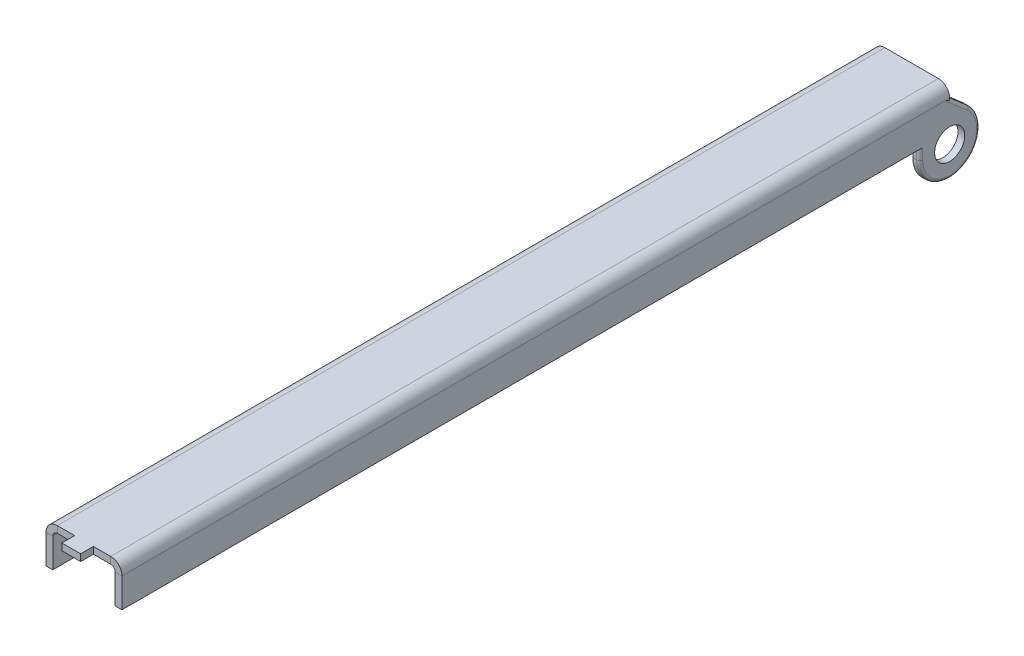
ISO-10303-21;
HEADER;
FILE_DESCRIPTION(('STEP AP214'),'2;1');
FILE_NAME('part.step','',(''),(''),'','','');
FILE_SCHEMA(('AUTOMOTIVE_DESIGN { 1 0 10303 214 1 1 1 1 }'));
ENDSEC;
DATA;
#1=APPLICATION_CONTEXT('core data for automotive mechanical design processes');
#2=APPLICATION_PROTOCOL_DEFINITION('international standard','automotive_design',2000,#1);
#3=PRODUCT_CONTEXT('',#1,'mechanical');
#4=PRODUCT('Part','Part','',(#3));
#5=PRODUCT_RELATED_PRODUCT_CATEGORY('part','',(#4));
#6=PRODUCT_DEFINITION_FORMATION('','',#4);
#7=PRODUCT_DEFINITION_CONTEXT('part definition',#1,'design');
#8=PRODUCT_DEFINITION('design','',#6,#7);
#9=PRODUCT_DEFINITION_SHAPE('','',#8);
#10=(LENGTH_UNIT() NAMED_UNIT(*) SI_UNIT(.MILLI.,.METRE.));
#11=(NAMED_UNIT(*) PLANE_ANGLE_UNIT() SI_UNIT($,.RADIAN.));
#12=(NAMED_UNIT(*) SI_UNIT($,.STERADIAN.) SOLID_ANGLE_UNIT());
#13=UNCERTAINTY_MEASURE_WITH_UNIT(LENGTH_MEASURE(1.E-05),#10,'distance_accuracy_value','');
#14=(GEOMETRIC_REPRESENTATION_CONTEXT(3) GLOBAL_UNCERTAINTY_ASSIGNED_CONTEXT((#13)) GLOBAL_UNIT_ASSIGNED_CONTEXT((#10,
#11,#12)) REPRESENTATION_CONTEXT('',''));
#15=CARTESIAN_POINT('',(0.,0.,0.));
#16=DIRECTION('',(0.,0.,1.));
#17=DIRECTION('',(1.,0.,0.));
#18=AXIS2_PLACEMENT_3D('',#15,#16,#17);
#19=CARTESIAN_POINT('',(-5.2705,-1.905,139.7));
#20=DIRECTION('',(0.,0.,1.));
#21=DIRECTION('',(1.,0.,0.));
#22=AXIS2_PLACEMENT_3D('',#19,#20,#21);
#23=PLANE('',#22);
#24=DIRECTION('',(0.,1.,0.));
#25=VECTOR('',#24,1.);
#26=CARTESIAN_POINT('',(1.5875,-1.143,139.7));
#27=LINE('',#26,#25);
#28=CARTESIAN_POINT('',(1.5875,-1.143,139.7));
#29=VERTEX_POINT('',#28);
#30=CARTESIAN_POINT('',(1.5875,0.,139.7));
#31=VERTEX_POINT('',#30);
#32=EDGE_CURVE('E237',#29,#31,#27,.T.);
#33=ORIENTED_EDGE('',*,*,#32,.F.);
#34=DIRECTION('',(1.,0.,0.));
#35=VECTOR('',#34,1.);
#36=CARTESIAN_POINT('',(-6.4135,-1.143,139.7));
#37=LINE('',#36,#35);
#38=CARTESIAN_POINT('',(4.5085,-1.143,139.7));
#39=VERTEX_POINT('',#38);
#40=EDGE_CURVE('E329',#29,#39,#37,.T.);
#41=ORIENTED_EDGE('',*,*,#40,.T.);
#42=DIRECTION('',(0.,1.,0.));
#43=VECTOR('',#42,1.);
#44=CARTESIAN_POINT('',(4.5085,-1.143,139.7));
#45=LINE('',#44,#43);
#46=CARTESIAN_POINT('',(4.5085,0.,139.7));
#47=VERTEX_POINT('',#46);
#48=EDGE_CURVE('E372',#39,#47,#45,.T.);
#49=ORIENTED_EDGE('',*,*,#48,.T.);
#50=DIRECTION('',(1.,0.,0.));
#51=VECTOR('',#50,1.);
#52=CARTESIAN_POINT('',(-6.4135,0.,139.7));
#53=LINE('',#52,#51);
#54=EDGE_CURVE('E312',#31,#47,#53,.T.);
#55=ORIENTED_EDGE('',*,*,#54,.F.);
#56=EDGE_LOOP('',(#33,#41,#49,#55));
#57=FACE_BOUND('',#56,.T.);
#58=ADVANCED_FACE('F33',(#57),#23,.T.);
#59=CARTESIAN_POINT('',(-4.5085,0.,139.7));
#60=DIRECTION('',(0.,0.,1.));
#61=DIRECTION('',(1.,0.,0.));
#62=AXIS2_PLACEMENT_3D('',#59,#60,#61);
#63=PLANE('',#62);
#64=DIRECTION('',(0.,-1.,0.));
#65=VECTOR('',#64,1.);
#66=CARTESIAN_POINT('',(-4.5085,0.,139.7));
#67=LINE('',#66,#65);
#68=CARTESIAN_POINT('',(-4.5085,0.,139.7));
#69=VERTEX_POINT('',#68);
#70=CARTESIAN_POINT('',(-4.5085,-1.143,139.7));
#71=VERTEX_POINT('',#70);
#72=EDGE_CURVE('E383',#69,#71,#67,.T.);
#73=ORIENTED_EDGE('',*,*,#72,.F.);
#74=CARTESIAN_POINT('',(-4.5085,-1.905,139.7));
#75=DIRECTION('',(0.,0.,1.));
#76=DIRECTION('',(1.,0.,0.));
#77=AXIS2_PLACEMENT_3D('',#74,#75,#76);
#78=CIRCLE('',#77,1.905);
#79=CARTESIAN_POINT('',(-6.4135,-1.905,139.7));
#80=VERTEX_POINT('',#79);
#81=EDGE_CURVE('E314',#80,#69,#78,.F.);
#82=ORIENTED_EDGE('',*,*,#81,.F.);
#83=DIRECTION('',(-1.,0.,0.));
#84=VECTOR('',#83,1.);
#85=CARTESIAN_POINT('',(-5.2705,-1.905,139.7));
#86=LINE('',#85,#84);
#87=CARTESIAN_POINT('',(-5.2705,-1.905,139.7));
#88=VERTEX_POINT('',#87);
#89=EDGE_CURVE('E381',#88,#80,#86,.T.);
#90=ORIENTED_EDGE('',*,*,#89,.F.);
#91=CARTESIAN_POINT('',(-4.5085,-1.905,139.7));
#92=DIRECTION('',(0.,0.,1.));
#93=DIRECTION('',(1.,0.,0.));
#94=AXIS2_PLACEMENT_3D('',#91,#92,#93);
#95=CIRCLE('',#94,0.762);
#96=EDGE_CURVE('E326',#88,#71,#95,.F.);
#97=ORIENTED_EDGE('',*,*,#96,.T.);
#98=EDGE_LOOP('',(#73,#82,#90,#97));
#99=FACE_BOUND('',#98,.T.);
#100=ADVANCED_FACE('F35',(#99),#63,.T.);
#101=DIRECTION('',(0.,1.,0.));
#102=VECTOR('',#101,1.);
#103=CARTESIAN_POINT('',(-1.5875,-1.143,139.7));
#104=LINE('',#103,#102);
#105=CARTESIAN_POINT('',(-1.5875,-1.143,139.7));
#106=VERTEX_POINT('',#105);
#107=CARTESIAN_POINT('',(-1.5875,0.,139.7));
#108=VERTEX_POINT('',#107);
#109=EDGE_CURVE('E212',#106,#108,#104,.T.);
#110=ORIENTED_EDGE('',*,*,#109,.T.);
#111=EDGE_CURVE('E223',#69,#108,#53,.T.);
#112=ORIENTED_EDGE('',*,*,#111,.F.);
#113=ORIENTED_EDGE('',*,*,#72,.T.);
#114=EDGE_CURVE('E330',#71,#106,#37,.T.);
#115=ORIENTED_EDGE('',*,*,#114,.T.);
#116=EDGE_LOOP('',(#110,#112,#113,#115));
#117=FACE_BOUND('',#116,.T.);
#118=ADVANCED_FACE('F466',(#117),#23,.T.);
#119=CARTESIAN_POINT('',(-6.4135,-1.905,0.));
#120=DIRECTION('',(0.,0.,-1.));
#121=DIRECTION('',(-1.,0.,0.));
#122=AXIS2_PLACEMENT_3D('',#119,#120,#121);
#123=PLANE('',#122);
#124=DIRECTION('',(1.,0.,0.));
#125=VECTOR('',#124,1.);
#126=CARTESIAN_POINT('',(-6.4135,-1.905,0.));
#127=LINE('',#126,#125);
#128=CARTESIAN_POINT('',(-5.9055,-1.905,0.));
#129=VERTEX_POINT('',#128);
#130=CARTESIAN_POINT('',(-5.2705,-1.905,0.));
#131=VERTEX_POINT('',#130);
#132=EDGE_CURVE('E379',#129,#131,#127,.T.);
#133=ORIENTED_EDGE('',*,*,#132,.F.);
#134=CARTESIAN_POINT('',(-5.9055,-2.57810000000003,0.));
#135=DIRECTION('',(0.,0.,-1.));
#136=DIRECTION('',(0.,-1.,0.));
#137=AXIS2_PLACEMENT_3D('',#134,#135,#136);
#138=ELLIPSE('',#137,0.6731,0.508);
#139=CARTESIAN_POINT('',(-6.37055128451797,-2.30723129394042,0.));
#140=VERTEX_POINT('',#139);
#141=EDGE_CURVE('E414',#129,#140,#138,.F.);
#142=ORIENTED_EDGE('',*,*,#141,.T.);
#143=CARTESIAN_POINT('',(-4.5085,-1.905,0.));
#144=DIRECTION('',(0.,0.,1.));
#145=DIRECTION('',(1.,0.,0.));
#146=AXIS2_PLACEMENT_3D('',#143,#144,#145);
#147=CIRCLE('',#146,1.905);
#148=CARTESIAN_POINT('',(-4.5085,0.,0.));
#149=VERTEX_POINT('',#148);
#150=EDGE_CURVE('E55',#140,#149,#147,.F.);
#151=ORIENTED_EDGE('',*,*,#150,.T.);
#152=DIRECTION('',(0.,1.,0.));
#153=VECTOR('',#152,1.);
#154=CARTESIAN_POINT('',(-4.5085,-1.143,0.));
#155=LINE('',#154,#153);
#156=CARTESIAN_POINT('',(-4.5085,-1.143,0.));
#157=VERTEX_POINT('',#156);
#158=EDGE_CURVE('E377',#157,#149,#155,.T.);
#159=ORIENTED_EDGE('',*,*,#158,.F.);
#160=CARTESIAN_POINT('',(-4.5085,-1.905,0.));
#161=DIRECTION('',(0.,0.,1.));
#162=DIRECTION('',(1.,0.,0.));
#163=AXIS2_PLACEMENT_3D('',#160,#161,#162);
#164=CIRCLE('',#163,0.762);
#165=EDGE_CURVE('E292',#131,#157,#164,.F.);
#166=ORIENTED_EDGE('',*,*,#165,.F.);
#167=EDGE_LOOP('',(#133,#142,#151,#159,#166));
#168=FACE_BOUND('',#167,.T.);
#169=ADVANCED_FACE('F475',(#168),#123,.T.);
#170=CARTESIAN_POINT('',(6.4135,-1.905,139.7));
#171=DIRECTION('',(0.,0.,1.));
#172=DIRECTION('',(1.,0.,0.));
#173=AXIS2_PLACEMENT_3D('',#170,#171,#172);
#174=PLANE('',#173);
#175=DIRECTION('',(-1.,0.,0.));
#176=VECTOR('',#175,1.);
#177=CARTESIAN_POINT('',(6.4135,-1.905,139.7));
#178=LINE('',#177,#176);
#179=CARTESIAN_POINT('',(6.4135,-1.905,139.7));
#180=VERTEX_POINT('',#179);
#181=CARTESIAN_POINT('',(5.2705,-1.905,139.7));
#182=VERTEX_POINT('',#181);
#183=EDGE_CURVE('E375',#180,#182,#178,.T.);
#184=ORIENTED_EDGE('',*,*,#183,.F.);
#185=CARTESIAN_POINT('',(4.5085,-1.905,139.7));
#186=DIRECTION('',(0.,0.,1.));
#187=DIRECTION('',(1.,0.,0.));
#188=AXIS2_PLACEMENT_3D('',#185,#186,#187);
#189=CIRCLE('',#188,1.905);
#190=EDGE_CURVE('E309',#47,#180,#189,.F.);
#191=ORIENTED_EDGE('',*,*,#190,.F.);
#192=ORIENTED_EDGE('',*,*,#48,.F.);
#193=CARTESIAN_POINT('',(4.5085,-1.905,139.7));
#194=DIRECTION('',(0.,0.,1.));
#195=DIRECTION('',(1.,0.,0.));
#196=AXIS2_PLACEMENT_3D('',#193,#194,#195);
#197=CIRCLE('',#196,0.762);
#198=EDGE_CURVE('E332',#39,#182,#197,.F.);
#199=ORIENTED_EDGE('',*,*,#198,.T.);
#200=EDGE_LOOP('',(#184,#191,#192,#199));
#201=FACE_BOUND('',#200,.T.);
#202=ADVANCED_FACE('F480',(#201),#174,.T.);
#203=CARTESIAN_POINT('',(4.5085,-1.143,139.7));
#204=DIRECTION('',(0.,0.,1.));
#205=DIRECTION('',(1.,0.,0.));
#206=AXIS2_PLACEMENT_3D('',#203,#204,#205);
#207=PLANE('',#206);
#208=DIRECTION('',(0.,-1.,0.));
#209=VECTOR('',#208,1.);
#210=CARTESIAN_POINT('',(6.4135,0.,139.7));
#211=LINE('',#210,#209);
#212=CARTESIAN_POINT('',(6.4135,-6.858,139.7));
#213=VERTEX_POINT('',#212);
#214=EDGE_CURVE('E306',#180,#213,#211,.T.);
#215=ORIENTED_EDGE('',*,*,#214,.F.);
#216=ORIENTED_EDGE('',*,*,#183,.T.);
#217=DIRECTION('',(0.,1.,0.));
#218=VECTOR('',#217,1.);
#219=CARTESIAN_POINT('',(5.2705,0.,139.7));
#220=LINE('',#219,#218);
#221=CARTESIAN_POINT('',(5.2705,-6.858,139.7));
#222=VERTEX_POINT('',#221);
#223=EDGE_CURVE('E301',#182,#222,#220,.F.);
#224=ORIENTED_EDGE('',*,*,#223,.T.);
#225=DIRECTION('',(-1.,0.,0.));
#226=VECTOR('',#225,1.);
#227=CARTESIAN_POINT('',(6.4135,-6.858,139.7));
#228=LINE('',#227,#226);
#229=EDGE_CURVE('E303',#213,#222,#228,.T.);
#230=ORIENTED_EDGE('',*,*,#229,.F.);
#231=EDGE_LOOP('',(#215,#216,#224,#230));
#232=FACE_BOUND('',#231,.T.);
#233=ADVANCED_FACE('F587',(#232),#207,.T.);
#234=CARTESIAN_POINT('',(4.5085,0.,0.));
#235=DIRECTION('',(0.,0.,-1.));
#236=DIRECTION('',(-1.,0.,0.));
#237=AXIS2_PLACEMENT_3D('',#234,#235,#236);
#238=PLANE('',#237);
#239=DIRECTION('',(0.,-1.,0.));
#240=VECTOR('',#239,1.);
#241=CARTESIAN_POINT('',(4.5085,0.,0.));
#242=LINE('',#241,#240);
#243=CARTESIAN_POINT('',(4.5085,0.,0.));
#244=VERTEX_POINT('',#243);
#245=CARTESIAN_POINT('',(4.5085,-1.143,0.));
#246=VERTEX_POINT('',#245);
#247=EDGE_CURVE('E370',#244,#246,#242,.T.);
#248=ORIENTED_EDGE('',*,*,#247,.F.);
#249=CARTESIAN_POINT('',(4.5085,-1.905,0.));
#250=DIRECTION('',(0.,0.,1.));
#251=DIRECTION('',(1.,0.,0.));
#252=AXIS2_PLACEMENT_3D('',#249,#250,#251);
#253=CIRCLE('',#252,1.905);
#254=CARTESIAN_POINT('',(6.37055128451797,-2.3072312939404,0.));
#255=VERTEX_POINT('',#254);
#256=EDGE_CURVE('E47',#244,#255,#253,.F.);
#257=ORIENTED_EDGE('',*,*,#256,.T.);
#258=CARTESIAN_POINT('',(5.9055,-2.57809999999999,0.));
#259=DIRECTION('',(0.,0.,-1.));
#260=DIRECTION('',(0.,1.,0.));
#261=AXIS2_PLACEMENT_3D('',#258,#259,#260);
#262=ELLIPSE('',#261,0.6731,0.508);
#263=CARTESIAN_POINT('',(5.9055,-1.905,0.));
#264=VERTEX_POINT('',#263);
#265=EDGE_CURVE('E11',#255,#264,#262,.F.);
#266=ORIENTED_EDGE('',*,*,#265,.T.);
#267=DIRECTION('',(1.,0.,0.));
#268=VECTOR('',#267,1.);
#269=CARTESIAN_POINT('',(5.2705,-1.905,0.));
#270=LINE('',#269,#268);
#271=CARTESIAN_POINT('',(5.2705,-1.905,0.));
#272=VERTEX_POINT('',#271);
#273=EDGE_CURVE('E367',#272,#264,#270,.T.);
#274=ORIENTED_EDGE('',*,*,#273,.F.);
#275=CARTESIAN_POINT('',(4.5085,-1.905,0.));
#276=DIRECTION('',(0.,0.,1.));
#277=DIRECTION('',(1.,0.,0.));
#278=AXIS2_PLACEMENT_3D('',#275,#276,#277);
#279=CIRCLE('',#278,0.762);
#280=EDGE_CURVE('E298',#246,#272,#279,.F.);
#281=ORIENTED_EDGE('',*,*,#280,.F.);
#282=EDGE_LOOP('',(#248,#257,#266,#274,#281));
#283=FACE_BOUND('',#282,.T.);
#284=ADVANCED_FACE('F569',(#283),#238,.T.);
#285=CARTESIAN_POINT('',(5.2705,-1.905,0.));
#286=DIRECTION('',(0.,0.,-1.));
#287=DIRECTION('',(-1.,0.,0.));
#288=AXIS2_PLACEMENT_3D('',#285,#286,#287);
#289=PLANE('',#288);
#290=DIRECTION('',(1.,0.,0.));
#291=VECTOR('',#290,1.);
#292=CARTESIAN_POINT('',(-6.4135,0.,0.));
#293=LINE('',#292,#291);
#294=EDGE_CURVE('E288',#149,#244,#293,.T.);
#295=ORIENTED_EDGE('',*,*,#294,.T.);
#296=ORIENTED_EDGE('',*,*,#247,.T.);
#297=DIRECTION('',(1.,0.,0.));
#298=VECTOR('',#297,1.);
#299=CARTESIAN_POINT('',(-6.4135,-1.143,0.));
#300=LINE('',#299,#298);
#301=EDGE_CURVE('E295',#157,#246,#300,.T.);
#302=ORIENTED_EDGE('',*,*,#301,.F.);
#303=ORIENTED_EDGE('',*,*,#158,.T.);
#304=EDGE_LOOP('',(#295,#296,#302,#303));
#305=FACE_BOUND('',#304,.T.);
#306=ADVANCED_FACE('F562',(#305),#289,.T.);
#307=CARTESIAN_POINT('',(5.2705,0.,139.7));
#308=DIRECTION('',(1.,0.,0.));
#309=DIRECTION('',(0.,0.,-1.));
#310=AXIS2_PLACEMENT_3D('',#307,#308,#309);
#311=PLANE('',#310);
#312=CARTESIAN_POINT('',(5.2705,-8.636,0.));
#313=DIRECTION('',(1.,0.,0.));
#314=DIRECTION('',(0.,0.,-1.));
#315=AXIS2_PLACEMENT_3D('',#312,#313,#314);
#316=CIRCLE('',#315,2.54);
#317=CARTESIAN_POINT('',(5.2705,-8.636,-2.54));
#318=VERTEX_POINT('',#317);
#319=EDGE_CURVE('E249',#318,#318,#316,.T.);
#320=ORIENTED_EDGE('',*,*,#319,.T.);
#321=EDGE_LOOP('',(#320));
#322=FACE_BOUND('',#321,.T.);
#323=DIRECTION('',(0.,-1.,0.));
#324=VECTOR('',#323,1.);
#325=CARTESIAN_POINT('',(5.2705,-6.858,5.08));
#326=LINE('',#325,#324);
#327=CARTESIAN_POINT('',(5.2705,-6.858,5.08));
#328=VERTEX_POINT('',#327);
#329=CARTESIAN_POINT('',(5.2705,-8.636,5.08));
#330=VERTEX_POINT('',#329);
#331=EDGE_CURVE('E264',#328,#330,#326,.T.);
#332=ORIENTED_EDGE('',*,*,#331,.F.);
#333=DIRECTION('',(0.,0.,-1.));
#334=VECTOR('',#333,1.);
#335=CARTESIAN_POINT('',(5.2705,-6.858,139.7));
#336=LINE('',#335,#334);
#337=EDGE_CURVE('E365',#222,#328,#336,.T.);
#338=ORIENTED_EDGE('',*,*,#337,.F.);
#339=ORIENTED_EDGE('',*,*,#223,.F.);
#340=DIRECTION('',(0.,0.,-1.));
#341=VECTOR('',#340,1.);
#342=CARTESIAN_POINT('',(5.2705,-1.905,139.7));
#343=LINE('',#342,#341);
#344=EDGE_CURVE('E335',#182,#272,#343,.T.);
#345=ORIENTED_EDGE('',*,*,#344,.T.);
#346=DIRECTION('',(0.,0.656050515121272,0.754716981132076));
#347=VECTOR('',#346,1.);
#348=CARTESIAN_POINT('',(5.2705,-1.905,0.));
#349=LINE('',#348,#347);
#350=CARTESIAN_POINT('',(5.2705,-4.80203773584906,-3.33273661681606));
#351=VERTEX_POINT('',#350);
#352=EDGE_CURVE('E275',#351,#272,#349,.T.);
#353=ORIENTED_EDGE('',*,*,#352,.F.);
#354=CARTESIAN_POINT('',(5.2705,-8.636,0.));
#355=DIRECTION('',(1.,0.,0.));
#356=DIRECTION('',(0.,0.,-1.));
#357=AXIS2_PLACEMENT_3D('',#354,#355,#356);
#358=CIRCLE('',#357,5.08);
#359=EDGE_CURVE('E272',#330,#351,#358,.T.);
#360=ORIENTED_EDGE('',*,*,#359,.F.);
#361=EDGE_LOOP('',(#332,#338,#339,#345,#353,#360));
#362=FACE_BOUND('',#361,.T.);
#363=ADVANCED_FACE('F584',(#322,#362),#311,.F.);
#364=CARTESIAN_POINT('',(6.4135,-6.858,139.7));
#365=DIRECTION('',(0.,-1.,0.));
#366=DIRECTION('',(0.,0.,-1.));
#367=AXIS2_PLACEMENT_3D('',#364,#365,#366);
#368=PLANE('',#367);
#369=DIRECTION('',(1.,0.,0.));
#370=VECTOR('',#369,1.);
#371=CARTESIAN_POINT('',(5.2705,-6.858,5.08));
#372=LINE('',#371,#370);
#373=CARTESIAN_POINT('',(5.9055,-6.858,5.08));
#374=VERTEX_POINT('',#373);
#375=EDGE_CURVE('E278',#328,#374,#372,.T.);
#376=ORIENTED_EDGE('',*,*,#375,.T.);
#377=CARTESIAN_POINT('',(5.9055,-6.858,4.57199999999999));
#378=DIRECTION('',(0.,-1.,0.));
#379=DIRECTION('',(0.,0.,-1.));
#380=AXIS2_PLACEMENT_3D('',#377,#378,#379);
#381=CIRCLE('',#380,0.508);
#382=CARTESIAN_POINT('',(6.4135,-6.858,4.57199999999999));
#383=VERTEX_POINT('',#382);
#384=EDGE_CURVE('E448',#374,#383,#381,.F.);
#385=ORIENTED_EDGE('',*,*,#384,.T.);
#386=DIRECTION('',(0.,0.,-1.));
#387=VECTOR('',#386,1.);
#388=CARTESIAN_POINT('',(6.4135,-6.858,139.7));
#389=LINE('',#388,#387);
#390=EDGE_CURVE('E363',#213,#383,#389,.T.);
#391=ORIENTED_EDGE('',*,*,#390,.F.);
#392=ORIENTED_EDGE('',*,*,#229,.T.);
#393=ORIENTED_EDGE('',*,*,#337,.T.);
#394=EDGE_LOOP('',(#376,#385,#391,#392,#393));
#395=FACE_BOUND('',#394,.T.);
#396=ADVANCED_FACE('F513',(#395),#368,.T.);
#397=CARTESIAN_POINT('',(6.4135,0.,139.7));
#398=DIRECTION('',(1.,0.,0.));
#399=DIRECTION('',(0.,0.,-1.));
#400=AXIS2_PLACEMENT_3D('',#397,#398,#399);
#401=PLANE('',#400);
#402=ORIENTED_EDGE('',*,*,#390,.T.);
#403=DIRECTION('',(0.,-1.,0.));
#404=VECTOR('',#403,1.);
#405=CARTESIAN_POINT('',(6.4135,0.,4.57199999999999));
#406=LINE('',#405,#404);
#407=CARTESIAN_POINT('',(6.4135,-8.636,4.572));
#408=VERTEX_POINT('',#407);
#409=EDGE_CURVE('E403',#383,#408,#406,.T.);
#410=ORIENTED_EDGE('',*,*,#409,.T.);
#411=CARTESIAN_POINT('',(6.4135,-8.636,0.));
#412=DIRECTION('',(1.,0.,0.));
#413=DIRECTION('',(0.,0.,-1.));
#414=AXIS2_PLACEMENT_3D('',#411,#412,#413);
#415=CIRCLE('',#414,4.572);
#416=CARTESIAN_POINT('',(6.4135,-5.18543396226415,-2.99946295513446));
#417=VERTEX_POINT('',#416);
#418=EDGE_CURVE('E399',#408,#417,#415,.T.);
#419=ORIENTED_EDGE('',*,*,#418,.T.);
#420=DIRECTION('',(0.,0.656050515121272,0.754716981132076));
#421=VECTOR('',#420,1.);
#422=CARTESIAN_POINT('',(6.4135,67.7015253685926,80.8493027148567));
#423=LINE('',#422,#421);
#424=CARTESIAN_POINT('',(6.4135,-1.905,0.774330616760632));
#425=VERTEX_POINT('',#424);
#426=EDGE_CURVE('E401',#417,#425,#423,.T.);
#427=ORIENTED_EDGE('',*,*,#426,.T.);
#428=DIRECTION('',(0.,0.,-1.));
#429=VECTOR('',#428,1.);
#430=CARTESIAN_POINT('',(6.4135,-1.905,139.7));
#431=LINE('',#430,#429);
#432=EDGE_CURVE('E360',#180,#425,#431,.T.);
#433=ORIENTED_EDGE('',*,*,#432,.F.);
#434=ORIENTED_EDGE('',*,*,#214,.T.);
#435=EDGE_LOOP('',(#402,#410,#419,#427,#433,#434));
#436=FACE_BOUND('',#435,.T.);
#437=CARTESIAN_POINT('',(6.4135,-8.636,0.));
#438=DIRECTION('',(1.,0.,0.));
#439=DIRECTION('',(0.,0.,-1.));
#440=AXIS2_PLACEMENT_3D('',#437,#438,#439);
#441=CIRCLE('',#440,2.54);
#442=CARTESIAN_POINT('',(6.4135,-8.636,-2.54));
#443=VERTEX_POINT('',#442);
#444=EDGE_CURVE('E238',#443,#443,#441,.T.);
#445=ORIENTED_EDGE('',*,*,#444,.F.);
#446=EDGE_LOOP('',(#445));
#447=FACE_BOUND('',#446,.T.);
#448=ADVANCED_FACE('F442',(#436,#447),#401,.T.);
#449=CARTESIAN_POINT('',(4.5085,-1.905,139.7));
#450=DIRECTION('',(0.,0.,-1.));
#451=DIRECTION('',(-1.,0.,0.));
#452=AXIS2_PLACEMENT_3D('',#449,#450,#451);
#453=CYLINDRICAL_SURFACE('',#452,1.905);
#454=ORIENTED_EDGE('',*,*,#256,.F.);
#455=DIRECTION('',(0.,0.,-1.));
#456=VECTOR('',#455,1.);
#457=CARTESIAN_POINT('',(4.5085,0.,139.7));
#458=LINE('',#457,#456);
#459=EDGE_CURVE('E357',#47,#244,#458,.T.);
#460=ORIENTED_EDGE('',*,*,#459,.F.);
#461=ORIENTED_EDGE('',*,*,#190,.T.);
#462=ORIENTED_EDGE('',*,*,#432,.T.);
#463=CARTESIAN_POINT('',(6.37055128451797,-2.3072312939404,0.));
#464=CARTESIAN_POINT('',(6.37774041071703,-2.27393037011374,0.0632574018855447));
#465=CARTESIAN_POINT('',(6.38398381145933,-2.24072145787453,0.12666234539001));
#466=CARTESIAN_POINT('',(6.39464965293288,-2.17443445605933,0.253696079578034));
#467=CARTESIAN_POINT('',(6.39907204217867,-2.14135637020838,0.317324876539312));
#468=CARTESIAN_POINT('',(6.40970373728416,-2.04232678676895,0.508270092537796));
#469=CARTESIAN_POINT('',(6.41329579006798,-1.97649412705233,0.635809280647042));
#470=CARTESIAN_POINT('',(6.41349716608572,-1.90878571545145,0.766995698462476));
#471=CARTESIAN_POINT('',(6.41349998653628,-1.90689285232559,0.770663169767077));
#472=CARTESIAN_POINT('',(6.4135,-1.90499999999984,0.774330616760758));
#473=B_SPLINE_CURVE_WITH_KNOTS('',3,(#463,#464,#465,#466,#467,#468,#469,#470,#471,#472),
.UNSPECIFIED.,.F.,.F.,(4,2,2,2,4),(0.,0.215524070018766,0.431054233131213,0.861557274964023,
0.873938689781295),.UNSPECIFIED.);
#474=EDGE_CURVE('E41',#425,#255,#473,.F.);
#475=ORIENTED_EDGE('',*,*,#474,.T.);
#476=EDGE_LOOP('',(#454,#460,#461,#462,#475));
#477=FACE_BOUND('',#476,.T.);
#478=ADVANCED_FACE('F438',(#477),#453,.T.);
#479=CARTESIAN_POINT('',(-6.4135,0.,139.7));
#480=DIRECTION('',(0.,1.,0.));
#481=DIRECTION('',(0.,0.,1.));
#482=AXIS2_PLACEMENT_3D('',#479,#480,#481);
#483=PLANE('',#482);
#484=ORIENTED_EDGE('',*,*,#294,.F.);
#485=DIRECTION('',(0.,0.,-1.));
#486=VECTOR('',#485,1.);
#487=CARTESIAN_POINT('',(-4.5085,0.,139.7));
#488=LINE('',#487,#486);
#489=EDGE_CURVE('E355',#69,#149,#488,.T.);
#490=ORIENTED_EDGE('',*,*,#489,.F.);
#491=ORIENTED_EDGE('',*,*,#111,.T.);
#492=DIRECTION('',(0.,0.,1.));
#493=VECTOR('',#492,1.);
#494=CARTESIAN_POINT('',(-1.5875,0.,139.7));
#495=LINE('',#494,#493);
#496=CARTESIAN_POINT('',(-1.5875,0.,141.859));
#497=VERTEX_POINT('',#496);
#498=EDGE_CURVE('E204',#108,#497,#495,.T.);
#499=ORIENTED_EDGE('',*,*,#498,.T.);
#500=DIRECTION('',(1.,0.,0.));
#501=VECTOR('',#500,1.);
#502=CARTESIAN_POINT('',(1.5875,0.,141.859));
#503=LINE('',#502,#501);
#504=CARTESIAN_POINT('',(1.5875,0.,141.859));
#505=VERTEX_POINT('',#504);
#506=EDGE_CURVE('E220',#497,#505,#503,.T.);
#507=ORIENTED_EDGE('',*,*,#506,.T.);
#508=DIRECTION('',(0.,0.,-1.));
#509=VECTOR('',#508,1.);
#510=CARTESIAN_POINT('',(1.5875,0.,139.7));
#511=LINE('',#510,#509);
#512=EDGE_CURVE('E224',#505,#31,#511,.T.);
#513=ORIENTED_EDGE('',*,*,#512,.T.);
#514=ORIENTED_EDGE('',*,*,#54,.T.);
#515=ORIENTED_EDGE('',*,*,#459,.T.);
#516=EDGE_LOOP('',(#484,#490,#491,#499,#507,#513,#514,#515));
#517=FACE_BOUND('',#516,.T.);
#518=ADVANCED_FACE('F218',(#517),#483,.T.);
#519=CARTESIAN_POINT('',(-4.5085,-1.905,139.7));
#520=DIRECTION('',(0.,0.,-1.));
#521=DIRECTION('',(-1.,0.,0.));
#522=AXIS2_PLACEMENT_3D('',#519,#520,#521);
#523=CYLINDRICAL_SURFACE('',#522,1.905);
#524=ORIENTED_EDGE('',*,*,#150,.F.);
#525=CARTESIAN_POINT('',(-6.37055128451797,-2.30723129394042,0.));
#526=CARTESIAN_POINT('',(-6.37774041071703,-2.27393037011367,0.0632574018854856));
#527=CARTESIAN_POINT('',(-6.38398381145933,-2.24072145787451,0.126662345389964));
#528=CARTESIAN_POINT('',(-6.39464965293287,-2.17443445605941,0.253696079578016));
#529=CARTESIAN_POINT('',(-6.39907204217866,-2.14135637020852,0.31732487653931));
#530=CARTESIAN_POINT('',(-6.40970373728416,-2.04232678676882,0.508270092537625));
#531=CARTESIAN_POINT('',(-6.41329579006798,-1.97649412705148,0.635809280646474));
#532=CARTESIAN_POINT('',(-6.41349716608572,-1.90878571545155,0.766995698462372));
#533=CARTESIAN_POINT('',(-6.41349998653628,-1.90689285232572,0.770663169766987));
#534=CARTESIAN_POINT('',(-6.4135,-1.905,0.774330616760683));
#535=B_SPLINE_CURVE_WITH_KNOTS('',3,(#525,#526,#527,#528,#529,#530,#531,#532,#533,#534),
.UNSPECIFIED.,.F.,.F.,(4,2,2,2,4),(0.,0.215524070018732,0.43105423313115,0.861557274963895,
0.873938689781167),.UNSPECIFIED.);
#536=CARTESIAN_POINT('',(-6.4135,-1.905,0.774330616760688));
#537=VERTEX_POINT('',#536);
#538=EDGE_CURVE('E416',#140,#537,#535,.T.);
#539=ORIENTED_EDGE('',*,*,#538,.T.);
#540=DIRECTION('',(0.,0.,-1.));
#541=VECTOR('',#540,1.);
#542=CARTESIAN_POINT('',(-6.4135,-1.905,139.7));
#543=LINE('',#542,#541);
#544=EDGE_CURVE('E352',#80,#537,#543,.T.);
#545=ORIENTED_EDGE('',*,*,#544,.F.);
#546=ORIENTED_EDGE('',*,*,#81,.T.);
#547=ORIENTED_EDGE('',*,*,#489,.T.);
#548=EDGE_LOOP('',(#524,#539,#545,#546,#547));
#549=FACE_BOUND('',#548,.T.);
#550=ADVANCED_FACE('F429',(#549),#523,.T.);
#551=CARTESIAN_POINT('',(-6.4135,0.,139.7));
#552=DIRECTION('',(-1.,0.,0.));
#553=DIRECTION('',(0.,0.,1.));
#554=AXIS2_PLACEMENT_3D('',#551,#552,#553);
#555=PLANE('',#554);
#556=CARTESIAN_POINT('',(-6.4135,-8.636,0.));
#557=DIRECTION('',(-1.,0.,0.));
#558=DIRECTION('',(0.,0.,1.));
#559=AXIS2_PLACEMENT_3D('',#556,#557,#558);
#560=CIRCLE('',#559,2.54);
#561=CARTESIAN_POINT('',(-6.4135,-8.636,2.54));
#562=VERTEX_POINT('',#561);
#563=EDGE_CURVE('E246',#562,#562,#560,.T.);
#564=ORIENTED_EDGE('',*,*,#563,.F.);
#565=EDGE_LOOP('',(#564));
#566=FACE_BOUND('',#565,.T.);
#567=DIRECTION('',(0.,1.,0.));
#568=VECTOR('',#567,1.);
#569=CARTESIAN_POINT('',(-6.4135,0.,4.57199999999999));
#570=LINE('',#569,#568);
#571=CARTESIAN_POINT('',(-6.4135,-8.636,4.572));
#572=VERTEX_POINT('',#571);
#573=CARTESIAN_POINT('',(-6.4135,-6.858,4.57199999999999));
#574=VERTEX_POINT('',#573);
#575=EDGE_CURVE('E389',#572,#574,#570,.T.);
#576=ORIENTED_EDGE('',*,*,#575,.T.);
#577=DIRECTION('',(0.,0.,-1.));
#578=VECTOR('',#577,1.);
#579=CARTESIAN_POINT('',(-6.4135,-6.858,139.7));
#580=LINE('',#579,#578);
#581=CARTESIAN_POINT('',(-6.4135,-6.858,139.7));
#582=VERTEX_POINT('',#581);
#583=EDGE_CURVE('E350',#582,#574,#580,.T.);
#584=ORIENTED_EDGE('',*,*,#583,.F.);
#585=DIRECTION('',(0.,1.,0.));
#586=VECTOR('',#585,1.);
#587=CARTESIAN_POINT('',(-6.4135,0.,139.7));
#588=LINE('',#587,#586);
#589=EDGE_CURVE('E317',#582,#80,#588,.T.);
#590=ORIENTED_EDGE('',*,*,#589,.T.);
#591=ORIENTED_EDGE('',*,*,#544,.T.);
#592=DIRECTION('',(0.,-0.656050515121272,-0.754716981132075));
#593=VECTOR('',#592,1.);
#594=CARTESIAN_POINT('',(-6.4135,67.7015253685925,80.8493027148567));
#595=LINE('',#594,#593);
#596=CARTESIAN_POINT('',(-6.4135,-5.18543396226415,-2.99946295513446));
#597=VERTEX_POINT('',#596);
#598=EDGE_CURVE('E392',#537,#597,#595,.T.);
#599=ORIENTED_EDGE('',*,*,#598,.T.);
#600=CARTESIAN_POINT('',(-6.4135,-8.636,0.));
#601=DIRECTION('',(-1.,0.,0.));
#602=DIRECTION('',(0.,0.,1.));
#603=AXIS2_PLACEMENT_3D('',#600,#601,#602);
#604=CIRCLE('',#603,4.572);
#605=EDGE_CURVE('E385',#597,#572,#604,.T.);
#606=ORIENTED_EDGE('',*,*,#605,.T.);
#607=EDGE_LOOP('',(#576,#584,#590,#591,#599,#606));
#608=FACE_BOUND('',#607,.T.);
#609=ADVANCED_FACE('F434',(#566,#608),#555,.T.);
#610=CARTESIAN_POINT('',(-5.2705,-6.858,139.7));
#611=DIRECTION('',(0.,-1.,0.));
#612=DIRECTION('',(0.,0.,-1.));
#613=AXIS2_PLACEMENT_3D('',#610,#611,#612);
#614=PLANE('',#613);
#615=DIRECTION('',(-1.,0.,0.));
#616=VECTOR('',#615,1.);
#617=CARTESIAN_POINT('',(-5.2705,-6.858,5.08));
#618=LINE('',#617,#616);
#619=CARTESIAN_POINT('',(-5.2705,-6.858,5.08));
#620=VERTEX_POINT('',#619);
#621=CARTESIAN_POINT('',(-5.9055,-6.858,5.08));
#622=VERTEX_POINT('',#621);
#623=EDGE_CURVE('E261',#620,#622,#618,.T.);
#624=ORIENTED_EDGE('',*,*,#623,.F.);
#625=DIRECTION('',(0.,0.,-1.));
#626=VECTOR('',#625,1.);
#627=CARTESIAN_POINT('',(-5.2705,-6.858,139.7));
#628=LINE('',#627,#626);
#629=CARTESIAN_POINT('',(-5.2705,-6.858,139.7));
#630=VERTEX_POINT('',#629);
#631=EDGE_CURVE('E347',#630,#620,#628,.T.);
#632=ORIENTED_EDGE('',*,*,#631,.F.);
#633=DIRECTION('',(-1.,0.,0.));
#634=VECTOR('',#633,1.);
#635=CARTESIAN_POINT('',(-5.2705,-6.858,139.7));
#636=LINE('',#635,#634);
#637=EDGE_CURVE('E320',#630,#582,#636,.T.);
#638=ORIENTED_EDGE('',*,*,#637,.T.);
#639=ORIENTED_EDGE('',*,*,#583,.T.);
#640=CARTESIAN_POINT('',(-5.9055,-6.858,4.57199999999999));
#641=DIRECTION('',(0.,-1.,0.));
#642=DIRECTION('',(0.,0.,-1.));
#643=AXIS2_PLACEMENT_3D('',#640,#641,#642);
#644=CIRCLE('',#643,0.508);
#645=EDGE_CURVE('E423',#574,#622,#644,.F.);
#646=ORIENTED_EDGE('',*,*,#645,.T.);
#647=EDGE_LOOP('',(#624,#632,#638,#639,#646));
#648=FACE_BOUND('',#647,.T.);
#649=ADVANCED_FACE('F518',(#648),#614,.T.);
#650=CARTESIAN_POINT('',(-5.2705,0.,139.7));
#651=DIRECTION('',(-1.,0.,0.));
#652=DIRECTION('',(0.,0.,1.));
#653=AXIS2_PLACEMENT_3D('',#650,#651,#652);
#654=PLANE('',#653);
#655=CARTESIAN_POINT('',(-5.2705,-8.636,0.));
#656=DIRECTION('',(-1.,0.,0.));
#657=DIRECTION('',(0.,0.,1.));
#658=AXIS2_PLACEMENT_3D('',#655,#656,#657);
#659=CIRCLE('',#658,2.54);
#660=CARTESIAN_POINT('',(-5.2705,-8.636,2.54));
#661=VERTEX_POINT('',#660);
#662=EDGE_CURVE('E245',#661,#661,#659,.T.);
#663=ORIENTED_EDGE('',*,*,#662,.T.);
#664=EDGE_LOOP('',(#663));
#665=FACE_BOUND('',#664,.T.);
#666=ORIENTED_EDGE('',*,*,#631,.T.);
#667=DIRECTION('',(0.,1.,0.));
#668=VECTOR('',#667,1.);
#669=CARTESIAN_POINT('',(-5.2705,-6.858,5.08));
#670=LINE('',#669,#668);
#671=CARTESIAN_POINT('',(-5.2705,-8.636,5.08));
#672=VERTEX_POINT('',#671);
#673=EDGE_CURVE('E258',#672,#620,#670,.T.);
#674=ORIENTED_EDGE('',*,*,#673,.F.);
#675=CARTESIAN_POINT('',(-5.2705,-8.636,0.));
#676=DIRECTION('',(-1.,0.,0.));
#677=DIRECTION('',(0.,0.,1.));
#678=AXIS2_PLACEMENT_3D('',#675,#676,#677);
#679=CIRCLE('',#678,5.08);
#680=CARTESIAN_POINT('',(-5.2705,-4.80203773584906,-3.33273661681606));
#681=VERTEX_POINT('',#680);
#682=EDGE_CURVE('E255',#681,#672,#679,.T.);
#683=ORIENTED_EDGE('',*,*,#682,.F.);
#684=DIRECTION('',(0.,-0.656050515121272,-0.754716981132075));
#685=VECTOR('',#684,1.);
#686=CARTESIAN_POINT('',(-5.2705,-4.80203773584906,-3.33273661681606));
#687=LINE('',#686,#685);
#688=EDGE_CURVE('E252',#131,#681,#687,.T.);
#689=ORIENTED_EDGE('',*,*,#688,.F.);
#690=DIRECTION('',(0.,0.,-1.));
#691=VECTOR('',#690,1.);
#692=CARTESIAN_POINT('',(-5.2705,-1.905,139.7));
#693=LINE('',#692,#691);
#694=EDGE_CURVE('E344',#88,#131,#693,.T.);
#695=ORIENTED_EDGE('',*,*,#694,.F.);
#696=DIRECTION('',(0.,1.,0.));
#697=VECTOR('',#696,1.);
#698=CARTESIAN_POINT('',(-5.2705,0.,139.7));
#699=LINE('',#698,#697);
#700=EDGE_CURVE('E323',#630,#88,#699,.T.);
#701=ORIENTED_EDGE('',*,*,#700,.F.);
#702=EDGE_LOOP('',(#666,#674,#683,#689,#695,#701));
#703=FACE_BOUND('',#702,.T.);
#704=ADVANCED_FACE('F547',(#665,#703),#654,.F.);
#705=CARTESIAN_POINT('',(-4.5085,-1.905,139.7));
#706=DIRECTION('',(0.,0.,-1.));
#707=DIRECTION('',(-1.,0.,0.));
#708=AXIS2_PLACEMENT_3D('',#705,#706,#707);
#709=CYLINDRICAL_SURFACE('',#708,0.762);
#710=ORIENTED_EDGE('',*,*,#165,.T.);
#711=DIRECTION('',(0.,0.,-1.));
#712=VECTOR('',#711,1.);
#713=CARTESIAN_POINT('',(-4.5085,-1.143,139.7));
#714=LINE('',#713,#712);
#715=EDGE_CURVE('E341',#71,#157,#714,.T.);
#716=ORIENTED_EDGE('',*,*,#715,.F.);
#717=ORIENTED_EDGE('',*,*,#96,.F.);
#718=ORIENTED_EDGE('',*,*,#694,.T.);
#719=EDGE_LOOP('',(#710,#716,#717,#718));
#720=FACE_BOUND('',#719,.T.);
#721=ADVANCED_FACE('F551',(#720),#709,.F.);
#722=CARTESIAN_POINT('',(-6.4135,-1.143,139.7));
#723=DIRECTION('',(0.,1.,0.));
#724=DIRECTION('',(0.,0.,1.));
#725=AXIS2_PLACEMENT_3D('',#722,#723,#724);
#726=PLANE('',#725);
#727=ORIENTED_EDGE('',*,*,#301,.T.);
#728=DIRECTION('',(0.,0.,-1.));
#729=VECTOR('',#728,1.);
#730=CARTESIAN_POINT('',(4.5085,-1.143,139.7));
#731=LINE('',#730,#729);
#732=EDGE_CURVE('E338',#39,#246,#731,.T.);
#733=ORIENTED_EDGE('',*,*,#732,.F.);
#734=ORIENTED_EDGE('',*,*,#40,.F.);
#735=DIRECTION('',(0.,0.,-1.));
#736=VECTOR('',#735,1.);
#737=CARTESIAN_POINT('',(1.5875,-1.143,139.7));
#738=LINE('',#737,#736);
#739=CARTESIAN_POINT('',(1.5875,-1.143,141.859));
#740=VERTEX_POINT('',#739);
#741=EDGE_CURVE('E228',#740,#29,#738,.T.);
#742=ORIENTED_EDGE('',*,*,#741,.F.);
#743=DIRECTION('',(1.,0.,0.));
#744=VECTOR('',#743,1.);
#745=CARTESIAN_POINT('',(1.5875,-1.143,141.859));
#746=LINE('',#745,#744);
#747=CARTESIAN_POINT('',(-1.5875,-1.143,141.859));
#748=VERTEX_POINT('',#747);
#749=EDGE_CURVE('E235',#748,#740,#746,.T.);
#750=ORIENTED_EDGE('',*,*,#749,.F.);
#751=DIRECTION('',(0.,0.,1.));
#752=VECTOR('',#751,1.);
#753=CARTESIAN_POINT('',(-1.5875,-1.143,139.7));
#754=LINE('',#753,#752);
#755=EDGE_CURVE('E206',#106,#748,#754,.T.);
#756=ORIENTED_EDGE('',*,*,#755,.F.);
#757=ORIENTED_EDGE('',*,*,#114,.F.);
#758=ORIENTED_EDGE('',*,*,#715,.T.);
#759=EDGE_LOOP('',(#727,#733,#734,#742,#750,#756,#757,#758));
#760=FACE_BOUND('',#759,.T.);
#761=ADVANCED_FACE('F484',(#760),#726,.F.);
#762=CARTESIAN_POINT('',(4.5085,-1.905,139.7));
#763=DIRECTION('',(0.,0.,-1.));
#764=DIRECTION('',(-1.,0.,0.));
#765=AXIS2_PLACEMENT_3D('',#762,#763,#764);
#766=CYLINDRICAL_SURFACE('',#765,0.762);
#767=ORIENTED_EDGE('',*,*,#280,.T.);
#768=ORIENTED_EDGE('',*,*,#344,.F.);
#769=ORIENTED_EDGE('',*,*,#198,.F.);
#770=ORIENTED_EDGE('',*,*,#732,.T.);
#771=EDGE_LOOP('',(#767,#768,#769,#770));
#772=FACE_BOUND('',#771,.T.);
#773=ADVANCED_FACE('F567',(#772),#766,.F.);
#774=CARTESIAN_POINT('',(4.5085,-1.905,139.7));
#775=DIRECTION('',(0.,0.,1.));
#776=DIRECTION('',(1.,0.,0.));
#777=AXIS2_PLACEMENT_3D('',#774,#775,#776);
#778=PLANE('',#777);
#779=ORIENTED_EDGE('',*,*,#700,.T.);
#780=ORIENTED_EDGE('',*,*,#89,.T.);
#781=ORIENTED_EDGE('',*,*,#589,.F.);
#782=ORIENTED_EDGE('',*,*,#637,.F.);
#783=EDGE_LOOP('',(#779,#780,#781,#782));
#784=FACE_BOUND('',#783,.T.);
#785=ADVANCED_FACE('F558',(#784),#778,.T.);
#786=CARTESIAN_POINT('',(5.2705,-1.905,0.));
#787=DIRECTION('',(0.,0.754716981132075,-0.656050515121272));
#788=DIRECTION('',(0.,0.656050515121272,0.754716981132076));
#789=AXIS2_PLACEMENT_3D('',#786,#787,#788);
#790=PLANE('',#789);
#791=ORIENTED_EDGE('',*,*,#273,.T.);
#792=DIRECTION('',(0.,0.656050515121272,0.754716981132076));
#793=VECTOR('',#792,1.);
#794=CARTESIAN_POINT('',(5.9055,-1.905,0.));
#795=LINE('',#794,#793);
#796=CARTESIAN_POINT('',(5.9055,-4.80203773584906,-3.33273661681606));
#797=VERTEX_POINT('',#796);
#798=EDGE_CURVE('E408',#264,#797,#795,.F.);
#799=ORIENTED_EDGE('',*,*,#798,.T.);
#800=DIRECTION('',(1.,0.,0.));
#801=VECTOR('',#800,1.);
#802=CARTESIAN_POINT('',(5.2705,-4.80203773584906,-3.33273661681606));
#803=LINE('',#802,#801);
#804=EDGE_CURVE('E279',#351,#797,#803,.T.);
#805=ORIENTED_EDGE('',*,*,#804,.F.);
#806=ORIENTED_EDGE('',*,*,#352,.T.);
#807=EDGE_LOOP('',(#791,#799,#805,#806));
#808=FACE_BOUND('',#807,.T.);
#809=ADVANCED_FACE('F573',(#808),#790,.T.);
#810=CARTESIAN_POINT('',(5.2705,-8.636,0.));
#811=DIRECTION('',(1.,0.,0.));
#812=DIRECTION('',(0.,0.,-1.));
#813=AXIS2_PLACEMENT_3D('',#810,#811,#812);
#814=CYLINDRICAL_SURFACE('',#813,5.08);
#815=ORIENTED_EDGE('',*,*,#804,.T.);
#816=CARTESIAN_POINT('',(5.9055,-8.636,0.));
#817=DIRECTION('',(1.,0.,0.));
#818=DIRECTION('',(0.,0.,-1.));
#819=AXIS2_PLACEMENT_3D('',#816,#817,#818);
#820=CIRCLE('',#819,5.08);
#821=CARTESIAN_POINT('',(5.9055,-8.636,5.08));
#822=VERTEX_POINT('',#821);
#823=EDGE_CURVE('E412',#797,#822,#820,.F.);
#824=ORIENTED_EDGE('',*,*,#823,.T.);
#825=DIRECTION('',(1.,0.,0.));
#826=VECTOR('',#825,1.);
#827=CARTESIAN_POINT('',(5.2705,-8.636,5.08));
#828=LINE('',#827,#826);
#829=EDGE_CURVE('E282',#330,#822,#828,.T.);
#830=ORIENTED_EDGE('',*,*,#829,.F.);
#831=ORIENTED_EDGE('',*,*,#359,.T.);
#832=EDGE_LOOP('',(#815,#824,#830,#831));
#833=FACE_BOUND('',#832,.T.);
#834=ADVANCED_FACE('F577',(#833),#814,.T.);
#835=CARTESIAN_POINT('',(5.2705,-6.858,5.08));
#836=DIRECTION('',(0.,0.,1.));
#837=DIRECTION('',(0.,-1.,0.));
#838=AXIS2_PLACEMENT_3D('',#835,#836,#837);
#839=PLANE('',#838);
#840=ORIENTED_EDGE('',*,*,#829,.T.);
#841=DIRECTION('',(0.,-1.,0.));
#842=VECTOR('',#841,1.);
#843=CARTESIAN_POINT('',(5.9055,-6.858,5.08));
#844=LINE('',#843,#842);
#845=EDGE_CURVE('E406',#822,#374,#844,.F.);
#846=ORIENTED_EDGE('',*,*,#845,.T.);
#847=ORIENTED_EDGE('',*,*,#375,.F.);
#848=ORIENTED_EDGE('',*,*,#331,.T.);
#849=EDGE_LOOP('',(#840,#846,#847,#848));
#850=FACE_BOUND('',#849,.T.);
#851=ADVANCED_FACE('F580',(#850),#839,.T.);
#852=CARTESIAN_POINT('',(-5.2705,-6.858,5.08));
#853=DIRECTION('',(0.,0.,1.));
#854=DIRECTION('',(0.,-1.,0.));
#855=AXIS2_PLACEMENT_3D('',#852,#853,#854);
#856=PLANE('',#855);
#857=ORIENTED_EDGE('',*,*,#623,.T.);
#858=DIRECTION('',(0.,1.,0.));
#859=VECTOR('',#858,1.);
#860=CARTESIAN_POINT('',(-5.9055,-6.858,5.08));
#861=LINE('',#860,#859);
#862=CARTESIAN_POINT('',(-5.9055,-8.636,5.08));
#863=VERTEX_POINT('',#862);
#864=EDGE_CURVE('E397',#622,#863,#861,.F.);
#865=ORIENTED_EDGE('',*,*,#864,.T.);
#866=DIRECTION('',(-1.,0.,0.));
#867=VECTOR('',#866,1.);
#868=CARTESIAN_POINT('',(-5.2705,-8.636,5.08));
#869=LINE('',#868,#867);
#870=EDGE_CURVE('E265',#672,#863,#869,.T.);
#871=ORIENTED_EDGE('',*,*,#870,.F.);
#872=ORIENTED_EDGE('',*,*,#673,.T.);
#873=EDGE_LOOP('',(#857,#865,#871,#872));
#874=FACE_BOUND('',#873,.T.);
#875=ADVANCED_FACE('F523',(#874),#856,.T.);
#876=CARTESIAN_POINT('',(-5.2705,-8.636,0.));
#877=DIRECTION('',(-1.,0.,0.));
#878=DIRECTION('',(0.,0.,1.));
#879=AXIS2_PLACEMENT_3D('',#876,#877,#878);
#880=CYLINDRICAL_SURFACE('',#879,5.08);
#881=ORIENTED_EDGE('',*,*,#870,.T.);
#882=CARTESIAN_POINT('',(-5.9055,-8.636,0.));
#883=DIRECTION('',(-1.,0.,0.));
#884=DIRECTION('',(0.,0.,1.));
#885=AXIS2_PLACEMENT_3D('',#882,#883,#884);
#886=CIRCLE('',#885,5.08);
#887=CARTESIAN_POINT('',(-5.9055,-4.80203773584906,-3.33273661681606));
#888=VERTEX_POINT('',#887);
#889=EDGE_CURVE('E410',#863,#888,#886,.F.);
#890=ORIENTED_EDGE('',*,*,#889,.T.);
#891=DIRECTION('',(-1.,0.,0.));
#892=VECTOR('',#891,1.);
#893=CARTESIAN_POINT('',(-5.2705,-4.80203773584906,-3.33273661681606));
#894=LINE('',#893,#892);
#895=EDGE_CURVE('E260',#681,#888,#894,.T.);
#896=ORIENTED_EDGE('',*,*,#895,.F.);
#897=ORIENTED_EDGE('',*,*,#682,.T.);
#898=EDGE_LOOP('',(#881,#890,#896,#897));
#899=FACE_BOUND('',#898,.T.);
#900=ADVANCED_FACE('F533',(#899),#880,.T.);
#901=CARTESIAN_POINT('',(-5.2705,-4.80203773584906,-3.33273661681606));
#902=DIRECTION('',(0.,0.754716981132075,-0.656050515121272));
#903=DIRECTION('',(0.,0.656050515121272,0.754716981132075));
#904=AXIS2_PLACEMENT_3D('',#901,#902,#903);
#905=PLANE('',#904);
#906=ORIENTED_EDGE('',*,*,#895,.T.);
#907=DIRECTION('',(0.,-0.656050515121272,-0.754716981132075));
#908=VECTOR('',#907,1.);
#909=CARTESIAN_POINT('',(-5.9055,-4.80203773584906,-3.33273661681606));
#910=LINE('',#909,#908);
#911=EDGE_CURVE('E395',#888,#129,#910,.F.);
#912=ORIENTED_EDGE('',*,*,#911,.T.);
#913=ORIENTED_EDGE('',*,*,#132,.T.);
#914=ORIENTED_EDGE('',*,*,#688,.T.);
#915=EDGE_LOOP('',(#906,#912,#913,#914));
#916=FACE_BOUND('',#915,.T.);
#917=ADVANCED_FACE('F537',(#916),#905,.T.);
#918=CARTESIAN_POINT('',(-120.5865,-8.636,0.));
#919=DIRECTION('',(1.,0.,0.));
#920=DIRECTION('',(0.,0.,-1.));
#921=AXIS2_PLACEMENT_3D('',#918,#919,#920);
#922=CYLINDRICAL_SURFACE('',#921,2.54);
#923=ORIENTED_EDGE('',*,*,#563,.T.);
#924=EDGE_LOOP('',(#923));
#925=FACE_BOUND('',#924,.T.);
#926=ORIENTED_EDGE('',*,*,#662,.F.);
#927=EDGE_LOOP('',(#926));
#928=FACE_BOUND('',#927,.T.);
#929=ADVANCED_FACE('F679',(#925,#928),#922,.F.);
#930=ORIENTED_EDGE('',*,*,#444,.T.);
#931=EDGE_LOOP('',(#930));
#932=FACE_BOUND('',#931,.T.);
#933=ORIENTED_EDGE('',*,*,#319,.F.);
#934=EDGE_LOOP('',(#933));
#935=FACE_BOUND('',#934,.T.);
#936=ADVANCED_FACE('F718',(#932,#935),#922,.F.);
#937=CARTESIAN_POINT('',(1.5875,-1.143,139.7));
#938=DIRECTION('',(1.,0.,0.));
#939=DIRECTION('',(0.,0.,-1.));
#940=AXIS2_PLACEMENT_3D('',#937,#938,#939);
#941=PLANE('',#940);
#942=ORIENTED_EDGE('',*,*,#512,.F.);
#943=DIRECTION('',(0.,1.,0.));
#944=VECTOR('',#943,1.);
#945=CARTESIAN_POINT('',(1.5875,-1.143,141.859));
#946=LINE('',#945,#944);
#947=EDGE_CURVE('E211',#740,#505,#946,.T.);
#948=ORIENTED_EDGE('',*,*,#947,.F.);
#949=ORIENTED_EDGE('',*,*,#741,.T.);
#950=ORIENTED_EDGE('',*,*,#32,.T.);
#951=EDGE_LOOP('',(#942,#948,#949,#950));
#952=FACE_BOUND('',#951,.T.);
#953=ADVANCED_FACE('F488',(#952),#941,.T.);
#954=CARTESIAN_POINT('',(1.5875,-1.143,141.859));
#955=DIRECTION('',(0.,0.,1.));
#956=DIRECTION('',(1.,0.,0.));
#957=AXIS2_PLACEMENT_3D('',#954,#955,#956);
#958=PLANE('',#957);
#959=ORIENTED_EDGE('',*,*,#506,.F.);
#960=DIRECTION('',(0.,1.,0.));
#961=VECTOR('',#960,1.);
#962=CARTESIAN_POINT('',(-1.5875,-1.143,141.859));
#963=LINE('',#962,#961);
#964=EDGE_CURVE('E200',#748,#497,#963,.T.);
#965=ORIENTED_EDGE('',*,*,#964,.F.);
#966=ORIENTED_EDGE('',*,*,#749,.T.);
#967=ORIENTED_EDGE('',*,*,#947,.T.);
#968=EDGE_LOOP('',(#959,#965,#966,#967));
#969=FACE_BOUND('',#968,.T.);
#970=ADVANCED_FACE('F226',(#969),#958,.T.);
#971=CARTESIAN_POINT('',(-1.5875,-1.143,139.7));
#972=DIRECTION('',(-1.,0.,0.));
#973=DIRECTION('',(0.,0.,1.));
#974=AXIS2_PLACEMENT_3D('',#971,#972,#973);
#975=PLANE('',#974);
#976=ORIENTED_EDGE('',*,*,#498,.F.);
#977=ORIENTED_EDGE('',*,*,#109,.F.);
#978=ORIENTED_EDGE('',*,*,#755,.T.);
#979=ORIENTED_EDGE('',*,*,#964,.T.);
#980=EDGE_LOOP('',(#976,#977,#978,#979));
#981=FACE_BOUND('',#980,.T.);
#982=ADVANCED_FACE('F202',(#981),#975,.T.);
#983=CARTESIAN_POINT('',(-5.9055,0.,4.57199999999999));
#984=DIRECTION('',(0.,1.,0.));
#985=DIRECTION('',(0.,0.,1.));
#986=AXIS2_PLACEMENT_3D('',#983,#984,#985);
#987=CYLINDRICAL_SURFACE('',#986,0.508);
#988=ORIENTED_EDGE('',*,*,#645,.F.);
#989=ORIENTED_EDGE('',*,*,#575,.F.);
#990=CARTESIAN_POINT('',(-5.9055,-8.636,4.572));
#991=DIRECTION('',(0.,-1.,0.));
#992=DIRECTION('',(0.,0.,-1.));
#993=AXIS2_PLACEMENT_3D('',#990,#991,#992);
#994=CIRCLE('',#993,0.508);
#995=EDGE_CURVE('E489',#863,#572,#994,.T.);
#996=ORIENTED_EDGE('',*,*,#995,.F.);
#997=ORIENTED_EDGE('',*,*,#864,.F.);
#998=EDGE_LOOP('',(#988,#989,#996,#997));
#999=FACE_BOUND('',#998,.T.);
#1000=ADVANCED_FACE('F526',(#999),#987,.T.);
#1001=CARTESIAN_POINT('',(-5.9055,-8.636,0.));
#1002=DIRECTION('',(-1.,0.,0.));
#1003=DIRECTION('',(0.,0.,1.));
#1004=AXIS2_PLACEMENT_3D('',#1001,#1002,#1003);
#1005=TOROIDAL_SURFACE('',#1004,4.572,0.508);
#1006=ORIENTED_EDGE('',*,*,#995,.T.);
#1007=ORIENTED_EDGE('',*,*,#605,.F.);
#1008=CARTESIAN_POINT('',(-5.9055,-5.18543396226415,-2.99946295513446));
#1009=DIRECTION('',(0.,0.656050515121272,0.754716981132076));
#1010=DIRECTION('',(0.,-0.754716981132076,0.656050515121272));
#1011=AXIS2_PLACEMENT_3D('',#1008,#1009,#1010);
#1012=CIRCLE('',#1011,0.508);
#1013=EDGE_CURVE('E491',#888,#597,#1012,.T.);
#1014=ORIENTED_EDGE('',*,*,#1013,.F.);
#1015=ORIENTED_EDGE('',*,*,#889,.F.);
#1016=EDGE_LOOP('',(#1006,#1007,#1014,#1015));
#1017=FACE_BOUND('',#1016,.T.);
#1018=ADVANCED_FACE('F531',(#1017),#1005,.T.);
#1019=CARTESIAN_POINT('',(-5.9055,67.7015253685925,80.8493027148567));
#1020=DIRECTION('',(0.,-0.656050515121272,-0.754716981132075));
#1021=DIRECTION('',(0.,0.754716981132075,-0.656050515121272));
#1022=AXIS2_PLACEMENT_3D('',#1019,#1020,#1021);
#1023=CYLINDRICAL_SURFACE('',#1022,0.508);
#1024=ORIENTED_EDGE('',*,*,#141,.F.);
#1025=ORIENTED_EDGE('',*,*,#911,.F.);
#1026=ORIENTED_EDGE('',*,*,#1013,.T.);
#1027=ORIENTED_EDGE('',*,*,#598,.F.);
#1028=ORIENTED_EDGE('',*,*,#538,.F.);
#1029=EDGE_LOOP('',(#1024,#1025,#1026,#1027,#1028));
#1030=FACE_BOUND('',#1029,.T.);
#1031=ADVANCED_FACE('F425',(#1030),#1023,.T.);
#1032=CARTESIAN_POINT('',(5.9055,67.7015253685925,80.8493027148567));
#1033=DIRECTION('',(0.,0.656050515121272,0.754716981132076));
#1034=DIRECTION('',(0.,-0.754716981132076,0.656050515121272));
#1035=AXIS2_PLACEMENT_3D('',#1032,#1033,#1034);
#1036=CYLINDRICAL_SURFACE('',#1035,0.508);
#1037=ORIENTED_EDGE('',*,*,#474,.F.);
#1038=ORIENTED_EDGE('',*,*,#426,.F.);
#1039=CARTESIAN_POINT('',(5.9055,-5.18543396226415,-2.99946295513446));
#1040=DIRECTION('',(0.,-0.656050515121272,-0.754716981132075));
#1041=DIRECTION('',(0.,0.754716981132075,-0.656050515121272));
#1042=AXIS2_PLACEMENT_3D('',#1039,#1040,#1041);
#1043=CIRCLE('',#1042,0.508);
#1044=EDGE_CURVE('E495',#797,#417,#1043,.T.);
#1045=ORIENTED_EDGE('',*,*,#1044,.F.);
#1046=ORIENTED_EDGE('',*,*,#798,.F.);
#1047=ORIENTED_EDGE('',*,*,#265,.F.);
#1048=EDGE_LOOP('',(#1037,#1038,#1045,#1046,#1047));
#1049=FACE_BOUND('',#1048,.T.);
#1050=ADVANCED_FACE('F449',(#1049),#1036,.T.);
#1051=CARTESIAN_POINT('',(5.9055,-8.636,0.));
#1052=DIRECTION('',(1.,0.,0.));
#1053=DIRECTION('',(0.,0.,-1.));
#1054=AXIS2_PLACEMENT_3D('',#1051,#1052,#1053);
#1055=TOROIDAL_SURFACE('',#1054,4.572,0.508);
#1056=ORIENTED_EDGE('',*,*,#1044,.T.);
#1057=ORIENTED_EDGE('',*,*,#418,.F.);
#1058=CARTESIAN_POINT('',(5.9055,-8.636,4.572));
#1059=DIRECTION('',(0.,1.,0.));
#1060=DIRECTION('',(0.,0.,1.));
#1061=AXIS2_PLACEMENT_3D('',#1058,#1059,#1060);
#1062=CIRCLE('',#1061,0.508);
#1063=EDGE_CURVE('E498',#822,#408,#1062,.T.);
#1064=ORIENTED_EDGE('',*,*,#1063,.F.);
#1065=ORIENTED_EDGE('',*,*,#823,.F.);
#1066=EDGE_LOOP('',(#1056,#1057,#1064,#1065));
#1067=FACE_BOUND('',#1066,.T.);
#1068=ADVANCED_FACE('F453',(#1067),#1055,.T.);
#1069=CARTESIAN_POINT('',(5.9055,0.,4.57199999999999));
#1070=DIRECTION('',(0.,-1.,0.));
#1071=DIRECTION('',(0.,0.,-1.));
#1072=AXIS2_PLACEMENT_3D('',#1069,#1070,#1071);
#1073=CYLINDRICAL_SURFACE('',#1072,0.508);
#1074=ORIENTED_EDGE('',*,*,#384,.F.);
#1075=ORIENTED_EDGE('',*,*,#845,.F.);
#1076=ORIENTED_EDGE('',*,*,#1063,.T.);
#1077=ORIENTED_EDGE('',*,*,#409,.F.);
#1078=EDGE_LOOP('',(#1074,#1075,#1076,#1077));
#1079=FACE_BOUND('',#1078,.T.);
#1080=ADVANCED_FACE('F457',(#1079),#1073,.T.);
#1081=CLOSED_SHELL('',(#58,#100,#118,#169,#202,#233,#284,#306,#363,#396,#448,#478,#518,#550,
#609,#649,#704,#721,#761,#773,#785,#809,#834,#851,#875,#900,#917,#929,#936,#953,#970,#982,#1000,
#1018,#1031,#1050,#1068,#1080));
#1082=MANIFOLD_SOLID_BREP('B2',#1081);
#1083=ADVANCED_BREP_SHAPE_REPRESENTATION('',(#18,#1082),#14);
#1084=SHAPE_DEFINITION_REPRESENTATION(#9,#1083);
ENDSEC;
END-ISO-10303-21;
